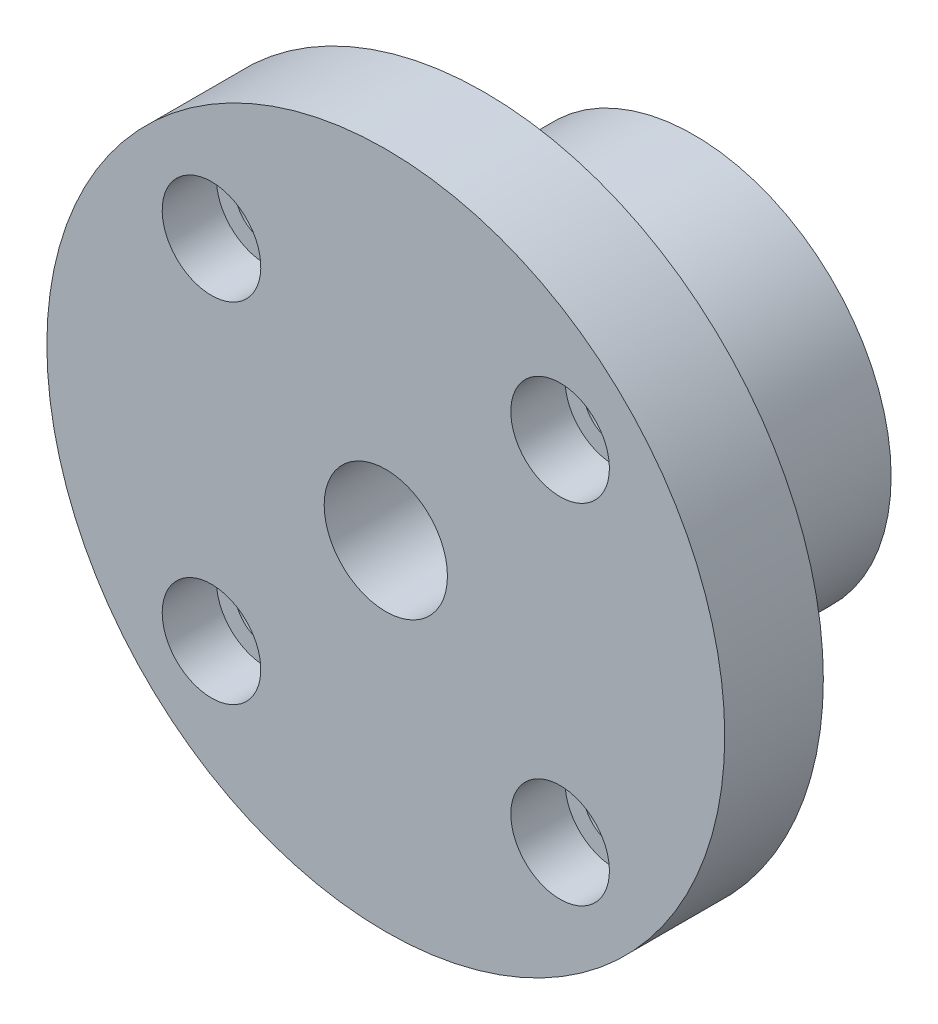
ISO-10303-21;
HEADER;
FILE_DESCRIPTION(('STEP AP214'),'2;1');
FILE_NAME('part.step','',(''),(''),'','','');
FILE_SCHEMA(('AUTOMOTIVE_DESIGN { 1 0 10303 214 1 1 1 1 }'));
ENDSEC;
DATA;
#1=APPLICATION_CONTEXT('core data for automotive mechanical design processes');
#2=APPLICATION_PROTOCOL_DEFINITION('international standard','automotive_design',2000,#1);
#3=PRODUCT_CONTEXT('',#1,'mechanical');
#4=PRODUCT('Part','Part','',(#3));
#5=PRODUCT_RELATED_PRODUCT_CATEGORY('part','',(#4));
#6=PRODUCT_DEFINITION_FORMATION('','',#4);
#7=PRODUCT_DEFINITION_CONTEXT('part definition',#1,'design');
#8=PRODUCT_DEFINITION('design','',#6,#7);
#9=PRODUCT_DEFINITION_SHAPE('','',#8);
#10=(LENGTH_UNIT() NAMED_UNIT(*) SI_UNIT(.MILLI.,.METRE.));
#11=(NAMED_UNIT(*) PLANE_ANGLE_UNIT() SI_UNIT($,.RADIAN.));
#12=(NAMED_UNIT(*) SI_UNIT($,.STERADIAN.) SOLID_ANGLE_UNIT());
#13=UNCERTAINTY_MEASURE_WITH_UNIT(LENGTH_MEASURE(1.E-05),#10,'distance_accuracy_value','');
#14=(GEOMETRIC_REPRESENTATION_CONTEXT(3) GLOBAL_UNCERTAINTY_ASSIGNED_CONTEXT((#13)) GLOBAL_UNIT_ASSIGNED_CONTEXT((#10,
#11,#12)) REPRESENTATION_CONTEXT('',''));
#15=CARTESIAN_POINT('',(0.,0.,0.));
#16=DIRECTION('',(0.,0.,1.));
#17=DIRECTION('',(1.,0.,0.));
#18=AXIS2_PLACEMENT_3D('',#15,#16,#17);
#19=CARTESIAN_POINT('',(0.,0.,0.));
#20=DIRECTION('',(0.,0.,1.));
#21=DIRECTION('',(1.,0.,0.));
#22=AXIS2_PLACEMENT_3D('',#19,#20,#21);
#23=PLANE('',#22);
#24=CARTESIAN_POINT('',(0.,0.,0.));
#25=DIRECTION('',(0.,0.,1.));
#26=DIRECTION('',(1.,0.,0.));
#27=AXIS2_PLACEMENT_3D('',#24,#25,#26);
#28=CIRCLE('',#27,27.5);
#29=CARTESIAN_POINT('',(27.5,0.,0.));
#30=VERTEX_POINT('',#29);
#31=EDGE_CURVE('E25',#30,#30,#28,.T.);
#32=ORIENTED_EDGE('',*,*,#31,.F.);
#33=EDGE_LOOP('',(#32));
#34=FACE_BOUND('',#33,.T.);
#35=CARTESIAN_POINT('',(14.1421356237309,14.142135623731,0.));
#36=DIRECTION('',(0.,0.,1.));
#37=DIRECTION('',(1.,0.,0.));
#38=AXIS2_PLACEMENT_3D('',#35,#36,#37);
#39=CIRCLE('',#38,2.5);
#40=CARTESIAN_POINT('',(16.6421356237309,14.142135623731,0.));
#41=VERTEX_POINT('',#40);
#42=EDGE_CURVE('E67',#41,#41,#39,.T.);
#43=ORIENTED_EDGE('',*,*,#42,.T.);
#44=EDGE_LOOP('',(#43));
#45=FACE_BOUND('',#44,.T.);
#46=CARTESIAN_POINT('',(14.142135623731,-14.1421356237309,0.));
#47=DIRECTION('',(0.,0.,1.));
#48=DIRECTION('',(0.,-1.,0.));
#49=AXIS2_PLACEMENT_3D('',#46,#47,#48);
#50=CIRCLE('',#49,2.5);
#51=CARTESIAN_POINT('',(14.142135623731,-16.6421356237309,0.));
#52=VERTEX_POINT('',#51);
#53=EDGE_CURVE('E57',#52,#52,#50,.T.);
#54=ORIENTED_EDGE('',*,*,#53,.T.);
#55=EDGE_LOOP('',(#54));
#56=FACE_BOUND('',#55,.T.);
#57=CARTESIAN_POINT('',(-14.142135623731,-14.1421356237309,0.));
#58=DIRECTION('',(0.,0.,1.));
#59=DIRECTION('',(-1.,0.,0.));
#60=AXIS2_PLACEMENT_3D('',#57,#58,#59);
#61=CIRCLE('',#60,2.5);
#62=CARTESIAN_POINT('',(-16.642135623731,-14.1421356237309,0.));
#63=VERTEX_POINT('',#62);
#64=EDGE_CURVE('E54',#63,#63,#61,.T.);
#65=ORIENTED_EDGE('',*,*,#64,.T.);
#66=EDGE_LOOP('',(#65));
#67=FACE_BOUND('',#66,.T.);
#68=CARTESIAN_POINT('',(-14.1421356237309,14.142135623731,0.));
#69=DIRECTION('',(0.,0.,1.));
#70=DIRECTION('',(0.,1.,0.));
#71=AXIS2_PLACEMENT_3D('',#68,#69,#70);
#72=CIRCLE('',#71,2.5);
#73=CARTESIAN_POINT('',(-14.1421356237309,16.642135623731,0.));
#74=VERTEX_POINT('',#73);
#75=EDGE_CURVE('E51',#74,#74,#72,.T.);
#76=ORIENTED_EDGE('',*,*,#75,.T.);
#77=EDGE_LOOP('',(#76));
#78=FACE_BOUND('',#77,.T.);
#79=CARTESIAN_POINT('',(0.,0.,0.));
#80=DIRECTION('',(0.,0.,1.));
#81=DIRECTION('',(1.,0.,0.));
#82=AXIS2_PLACEMENT_3D('',#79,#80,#81);
#83=CIRCLE('',#82,16.);
#84=CARTESIAN_POINT('',(16.,0.,0.));
#85=VERTEX_POINT('',#84);
#86=EDGE_CURVE('E8',#85,#85,#83,.F.);
#87=ORIENTED_EDGE('',*,*,#86,.F.);
#88=EDGE_LOOP('',(#87));
#89=FACE_BOUND('',#88,.T.);
#90=ADVANCED_FACE('F12',(#34,#45,#56,#67,#78,#89),#23,.F.);
#91=CARTESIAN_POINT('',(-14.1421356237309,14.142135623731,0.));
#92=DIRECTION('',(0.,0.,1.));
#93=DIRECTION('',(1.,0.,0.));
#94=AXIS2_PLACEMENT_3D('',#91,#92,#93);
#95=CYLINDRICAL_SURFACE('',#94,2.5);
#96=ORIENTED_EDGE('',*,*,#75,.F.);
#97=EDGE_LOOP('',(#96));
#98=FACE_BOUND('',#97,.T.);
#99=CARTESIAN_POINT('',(-14.1421356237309,14.142135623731,3.6));
#100=DIRECTION('',(0.,0.,1.));
#101=DIRECTION('',(1.,0.,0.));
#102=AXIS2_PLACEMENT_3D('',#99,#100,#101);
#103=CIRCLE('',#102,2.5);
#104=CARTESIAN_POINT('',(-11.6421356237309,14.142135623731,3.6));
#105=VERTEX_POINT('',#104);
#106=EDGE_CURVE('E16',#105,#105,#103,.F.);
#107=ORIENTED_EDGE('',*,*,#106,.F.);
#108=EDGE_LOOP('',(#107));
#109=FACE_BOUND('',#108,.T.);
#110=ADVANCED_FACE('F86',(#98,#109),#95,.F.);
#111=CARTESIAN_POINT('',(-14.142135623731,-14.1421356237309,0.));
#112=DIRECTION('',(0.,0.,1.));
#113=DIRECTION('',(1.,0.,0.));
#114=AXIS2_PLACEMENT_3D('',#111,#112,#113);
#115=CYLINDRICAL_SURFACE('',#114,2.5);
#116=ORIENTED_EDGE('',*,*,#64,.F.);
#117=EDGE_LOOP('',(#116));
#118=FACE_BOUND('',#117,.T.);
#119=CARTESIAN_POINT('',(-14.142135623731,-14.1421356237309,3.6));
#120=DIRECTION('',(0.,0.,1.));
#121=DIRECTION('',(1.,0.,0.));
#122=AXIS2_PLACEMENT_3D('',#119,#120,#121);
#123=CIRCLE('',#122,2.5);
#124=CARTESIAN_POINT('',(-11.642135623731,-14.1421356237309,3.6));
#125=VERTEX_POINT('',#124);
#126=EDGE_CURVE('E43',#125,#125,#123,.F.);
#127=ORIENTED_EDGE('',*,*,#126,.F.);
#128=EDGE_LOOP('',(#127));
#129=FACE_BOUND('',#128,.T.);
#130=ADVANCED_FACE('F83',(#118,#129),#115,.F.);
#131=CARTESIAN_POINT('',(14.142135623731,-14.1421356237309,0.));
#132=DIRECTION('',(0.,0.,1.));
#133=DIRECTION('',(1.,0.,0.));
#134=AXIS2_PLACEMENT_3D('',#131,#132,#133);
#135=CYLINDRICAL_SURFACE('',#134,2.5);
#136=ORIENTED_EDGE('',*,*,#53,.F.);
#137=EDGE_LOOP('',(#136));
#138=FACE_BOUND('',#137,.T.);
#139=CARTESIAN_POINT('',(14.142135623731,-14.1421356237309,3.6));
#140=DIRECTION('',(0.,0.,1.));
#141=DIRECTION('',(1.,0.,0.));
#142=AXIS2_PLACEMENT_3D('',#139,#140,#141);
#143=CIRCLE('',#142,2.5);
#144=CARTESIAN_POINT('',(16.642135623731,-14.1421356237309,3.6));
#145=VERTEX_POINT('',#144);
#146=EDGE_CURVE('E50',#145,#145,#143,.F.);
#147=ORIENTED_EDGE('',*,*,#146,.F.);
#148=EDGE_LOOP('',(#147));
#149=FACE_BOUND('',#148,.T.);
#150=ADVANCED_FACE('F85',(#138,#149),#135,.F.);
#151=CARTESIAN_POINT('',(14.1421356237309,14.142135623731,0.));
#152=DIRECTION('',(0.,0.,1.));
#153=DIRECTION('',(1.,0.,0.));
#154=AXIS2_PLACEMENT_3D('',#151,#152,#153);
#155=CYLINDRICAL_SURFACE('',#154,2.5);
#156=ORIENTED_EDGE('',*,*,#42,.F.);
#157=EDGE_LOOP('',(#156));
#158=FACE_BOUND('',#157,.T.);
#159=CARTESIAN_POINT('',(14.1421356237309,14.142135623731,3.6));
#160=DIRECTION('',(0.,0.,1.));
#161=DIRECTION('',(1.,0.,0.));
#162=AXIS2_PLACEMENT_3D('',#159,#160,#161);
#163=CIRCLE('',#162,2.5);
#164=CARTESIAN_POINT('',(16.6421356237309,14.142135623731,3.6));
#165=VERTEX_POINT('',#164);
#166=EDGE_CURVE('E66',#165,#165,#163,.F.);
#167=ORIENTED_EDGE('',*,*,#166,.F.);
#168=EDGE_LOOP('',(#167));
#169=FACE_BOUND('',#168,.T.);
#170=ADVANCED_FACE('F94',(#158,#169),#155,.F.);
#171=CARTESIAN_POINT('',(0.,0.,8.));
#172=DIRECTION('',(0.,0.,1.));
#173=DIRECTION('',(1.,0.,0.));
#174=AXIS2_PLACEMENT_3D('',#171,#172,#173);
#175=PLANE('',#174);
#176=CARTESIAN_POINT('',(-14.142135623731,-14.1421356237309,8.));
#177=DIRECTION('',(0.,0.,1.));
#178=DIRECTION('',(-1.,0.,0.));
#179=AXIS2_PLACEMENT_3D('',#176,#177,#178);
#180=CIRCLE('',#179,4.);
#181=CARTESIAN_POINT('',(-18.142135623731,-14.1421356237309,8.));
#182=VERTEX_POINT('',#181);
#183=EDGE_CURVE('E37',#182,#182,#180,.T.);
#184=ORIENTED_EDGE('',*,*,#183,.F.);
#185=EDGE_LOOP('',(#184));
#186=FACE_BOUND('',#185,.T.);
#187=CARTESIAN_POINT('',(-14.1421356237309,14.142135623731,8.));
#188=DIRECTION('',(0.,0.,1.));
#189=DIRECTION('',(0.,1.,0.));
#190=AXIS2_PLACEMENT_3D('',#187,#188,#189);
#191=CIRCLE('',#190,4.);
#192=CARTESIAN_POINT('',(-14.1421356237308,18.142135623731,8.));
#193=VERTEX_POINT('',#192);
#194=EDGE_CURVE('E31',#193,#193,#191,.T.);
#195=ORIENTED_EDGE('',*,*,#194,.F.);
#196=EDGE_LOOP('',(#195));
#197=FACE_BOUND('',#196,.T.);
#198=CARTESIAN_POINT('',(14.1421356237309,14.142135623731,8.));
#199=DIRECTION('',(0.,0.,1.));
#200=DIRECTION('',(1.,0.,0.));
#201=AXIS2_PLACEMENT_3D('',#198,#199,#200);
#202=CIRCLE('',#201,4.);
#203=CARTESIAN_POINT('',(18.1421356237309,14.142135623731,8.));
#204=VERTEX_POINT('',#203);
#205=EDGE_CURVE('E60',#204,#204,#202,.T.);
#206=ORIENTED_EDGE('',*,*,#205,.F.);
#207=EDGE_LOOP('',(#206));
#208=FACE_BOUND('',#207,.T.);
#209=CARTESIAN_POINT('',(14.142135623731,-14.1421356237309,8.));
#210=DIRECTION('',(0.,0.,1.));
#211=DIRECTION('',(0.,-1.,0.));
#212=AXIS2_PLACEMENT_3D('',#209,#210,#211);
#213=CIRCLE('',#212,4.);
#214=CARTESIAN_POINT('',(14.142135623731,-18.1421356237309,8.));
#215=VERTEX_POINT('',#214);
#216=EDGE_CURVE('E44',#215,#215,#213,.T.);
#217=ORIENTED_EDGE('',*,*,#216,.F.);
#218=EDGE_LOOP('',(#217));
#219=FACE_BOUND('',#218,.T.);
#220=CARTESIAN_POINT('',(0.,0.,8.));
#221=DIRECTION('',(0.,0.,1.));
#222=DIRECTION('',(1.,0.,0.));
#223=AXIS2_PLACEMENT_3D('',#220,#221,#222);
#224=CIRCLE('',#223,5.);
#225=CARTESIAN_POINT('',(5.,0.,8.));
#226=VERTEX_POINT('',#225);
#227=EDGE_CURVE('E70',#226,#226,#224,.T.);
#228=ORIENTED_EDGE('',*,*,#227,.F.);
#229=EDGE_LOOP('',(#228));
#230=FACE_BOUND('',#229,.T.);
#231=CARTESIAN_POINT('',(0.,0.,8.));
#232=DIRECTION('',(0.,0.,1.));
#233=DIRECTION('',(1.,0.,0.));
#234=AXIS2_PLACEMENT_3D('',#231,#232,#233);
#235=CIRCLE('',#234,27.5);
#236=CARTESIAN_POINT('',(27.5,0.,8.));
#237=VERTEX_POINT('',#236);
#238=EDGE_CURVE('E20',#237,#237,#235,.T.);
#239=ORIENTED_EDGE('',*,*,#238,.T.);
#240=EDGE_LOOP('',(#239));
#241=FACE_BOUND('',#240,.T.);
#242=ADVANCED_FACE('F110',(#186,#197,#208,#219,#230,#241),#175,.T.);
#243=CARTESIAN_POINT('',(0.,0.,8.));
#244=DIRECTION('',(0.,0.,-1.));
#245=DIRECTION('',(-1.,0.,0.));
#246=AXIS2_PLACEMENT_3D('',#243,#244,#245);
#247=CYLINDRICAL_SURFACE('',#246,27.5);
#248=ORIENTED_EDGE('',*,*,#238,.F.);
#249=EDGE_LOOP('',(#248));
#250=FACE_BOUND('',#249,.T.);
#251=ORIENTED_EDGE('',*,*,#31,.T.);
#252=EDGE_LOOP('',(#251));
#253=FACE_BOUND('',#252,.T.);
#254=ADVANCED_FACE('F14',(#250,#253),#247,.T.);
#255=CARTESIAN_POINT('',(0.,0.,8.));
#256=DIRECTION('',(0.,0.,-1.));
#257=DIRECTION('',(-1.,0.,0.));
#258=AXIS2_PLACEMENT_3D('',#255,#256,#257);
#259=CYLINDRICAL_SURFACE('',#258,5.);
#260=ORIENTED_EDGE('',*,*,#227,.T.);
#261=EDGE_LOOP('',(#260));
#262=FACE_BOUND('',#261,.T.);
#263=CARTESIAN_POINT('',(0.,0.,-17.));
#264=DIRECTION('',(0.,0.,-1.));
#265=DIRECTION('',(-1.,0.,0.));
#266=AXIS2_PLACEMENT_3D('',#263,#264,#265);
#267=CIRCLE('',#266,5.);
#268=CARTESIAN_POINT('',(-5.,0.,-17.));
#269=VERTEX_POINT('',#268);
#270=EDGE_CURVE('E137',#269,#269,#267,.T.);
#271=ORIENTED_EDGE('',*,*,#270,.T.);
#272=EDGE_LOOP('',(#271));
#273=FACE_BOUND('',#272,.T.);
#274=ADVANCED_FACE('F108',(#262,#273),#259,.F.);
#275=CARTESIAN_POINT('',(14.1421356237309,14.142135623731,3.6));
#276=DIRECTION('',(0.,0.,1.));
#277=DIRECTION('',(1.,0.,0.));
#278=AXIS2_PLACEMENT_3D('',#275,#276,#277);
#279=PLANE('',#278);
#280=CARTESIAN_POINT('',(14.1421356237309,14.142135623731,3.6));
#281=DIRECTION('',(0.,0.,1.));
#282=DIRECTION('',(1.,0.,0.));
#283=AXIS2_PLACEMENT_3D('',#280,#281,#282);
#284=CIRCLE('',#283,4.);
#285=CARTESIAN_POINT('',(18.1421356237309,14.142135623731,3.6));
#286=VERTEX_POINT('',#285);
#287=EDGE_CURVE('E63',#286,#286,#284,.T.);
#288=ORIENTED_EDGE('',*,*,#287,.T.);
#289=EDGE_LOOP('',(#288));
#290=FACE_BOUND('',#289,.T.);
#291=ORIENTED_EDGE('',*,*,#166,.T.);
#292=EDGE_LOOP('',(#291));
#293=FACE_BOUND('',#292,.T.);
#294=ADVANCED_FACE('F134',(#290,#293),#279,.T.);
#295=CARTESIAN_POINT('',(14.1421356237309,14.142135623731,3.6));
#296=DIRECTION('',(0.,0.,1.));
#297=DIRECTION('',(1.,0.,0.));
#298=AXIS2_PLACEMENT_3D('',#295,#296,#297);
#299=CYLINDRICAL_SURFACE('',#298,4.);
#300=ORIENTED_EDGE('',*,*,#205,.T.);
#301=EDGE_LOOP('',(#300));
#302=FACE_BOUND('',#301,.T.);
#303=ORIENTED_EDGE('',*,*,#287,.F.);
#304=EDGE_LOOP('',(#303));
#305=FACE_BOUND('',#304,.T.);
#306=ADVANCED_FACE('F171',(#302,#305),#299,.F.);
#307=CARTESIAN_POINT('',(14.142135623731,-14.1421356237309,3.6));
#308=DIRECTION('',(0.,0.,1.));
#309=DIRECTION('',(1.,0.,0.));
#310=AXIS2_PLACEMENT_3D('',#307,#308,#309);
#311=PLANE('',#310);
#312=CARTESIAN_POINT('',(14.142135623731,-14.1421356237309,3.6));
#313=DIRECTION('',(0.,0.,1.));
#314=DIRECTION('',(0.,-1.,0.));
#315=AXIS2_PLACEMENT_3D('',#312,#313,#314);
#316=CIRCLE('',#315,4.);
#317=CARTESIAN_POINT('',(14.142135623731,-18.1421356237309,3.6));
#318=VERTEX_POINT('',#317);
#319=EDGE_CURVE('E47',#318,#318,#316,.T.);
#320=ORIENTED_EDGE('',*,*,#319,.T.);
#321=EDGE_LOOP('',(#320));
#322=FACE_BOUND('',#321,.T.);
#323=ORIENTED_EDGE('',*,*,#146,.T.);
#324=EDGE_LOOP('',(#323));
#325=FACE_BOUND('',#324,.T.);
#326=ADVANCED_FACE('F168',(#322,#325),#311,.T.);
#327=CARTESIAN_POINT('',(14.142135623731,-14.1421356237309,3.6));
#328=DIRECTION('',(0.,0.,1.));
#329=DIRECTION('',(1.,0.,0.));
#330=AXIS2_PLACEMENT_3D('',#327,#328,#329);
#331=CYLINDRICAL_SURFACE('',#330,4.);
#332=ORIENTED_EDGE('',*,*,#216,.T.);
#333=EDGE_LOOP('',(#332));
#334=FACE_BOUND('',#333,.T.);
#335=ORIENTED_EDGE('',*,*,#319,.F.);
#336=EDGE_LOOP('',(#335));
#337=FACE_BOUND('',#336,.T.);
#338=ADVANCED_FACE('F163',(#334,#337),#331,.F.);
#339=CARTESIAN_POINT('',(-14.142135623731,-14.1421356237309,3.6));
#340=DIRECTION('',(0.,0.,1.));
#341=DIRECTION('',(1.,0.,0.));
#342=AXIS2_PLACEMENT_3D('',#339,#340,#341);
#343=PLANE('',#342);
#344=CARTESIAN_POINT('',(-14.142135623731,-14.1421356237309,3.6));
#345=DIRECTION('',(0.,0.,1.));
#346=DIRECTION('',(-1.,0.,0.));
#347=AXIS2_PLACEMENT_3D('',#344,#345,#346);
#348=CIRCLE('',#347,4.);
#349=CARTESIAN_POINT('',(-18.142135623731,-14.1421356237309,3.6));
#350=VERTEX_POINT('',#349);
#351=EDGE_CURVE('E40',#350,#350,#348,.T.);
#352=ORIENTED_EDGE('',*,*,#351,.T.);
#353=EDGE_LOOP('',(#352));
#354=FACE_BOUND('',#353,.T.);
#355=ORIENTED_EDGE('',*,*,#126,.T.);
#356=EDGE_LOOP('',(#355));
#357=FACE_BOUND('',#356,.T.);
#358=ADVANCED_FACE('F81',(#354,#357),#343,.T.);
#359=CARTESIAN_POINT('',(-14.142135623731,-14.1421356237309,3.6));
#360=DIRECTION('',(0.,0.,1.));
#361=DIRECTION('',(1.,0.,0.));
#362=AXIS2_PLACEMENT_3D('',#359,#360,#361);
#363=CYLINDRICAL_SURFACE('',#362,4.);
#364=ORIENTED_EDGE('',*,*,#183,.T.);
#365=EDGE_LOOP('',(#364));
#366=FACE_BOUND('',#365,.T.);
#367=ORIENTED_EDGE('',*,*,#351,.F.);
#368=EDGE_LOOP('',(#367));
#369=FACE_BOUND('',#368,.T.);
#370=ADVANCED_FACE('F158',(#366,#369),#363,.F.);
#371=CARTESIAN_POINT('',(-14.1421356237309,14.142135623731,3.6));
#372=DIRECTION('',(0.,0.,1.));
#373=DIRECTION('',(1.,0.,0.));
#374=AXIS2_PLACEMENT_3D('',#371,#372,#373);
#375=PLANE('',#374);
#376=CARTESIAN_POINT('',(-14.1421356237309,14.142135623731,3.6));
#377=DIRECTION('',(0.,0.,1.));
#378=DIRECTION('',(0.,1.,0.));
#379=AXIS2_PLACEMENT_3D('',#376,#377,#378);
#380=CIRCLE('',#379,4.);
#381=CARTESIAN_POINT('',(-14.1421356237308,18.142135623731,3.6));
#382=VERTEX_POINT('',#381);
#383=EDGE_CURVE('E34',#382,#382,#380,.T.);
#384=ORIENTED_EDGE('',*,*,#383,.T.);
#385=EDGE_LOOP('',(#384));
#386=FACE_BOUND('',#385,.T.);
#387=ORIENTED_EDGE('',*,*,#106,.T.);
#388=EDGE_LOOP('',(#387));
#389=FACE_BOUND('',#388,.T.);
#390=ADVANCED_FACE('F153',(#386,#389),#375,.T.);
#391=CARTESIAN_POINT('',(-14.1421356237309,14.142135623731,3.6));
#392=DIRECTION('',(0.,0.,1.));
#393=DIRECTION('',(1.,0.,0.));
#394=AXIS2_PLACEMENT_3D('',#391,#392,#393);
#395=CYLINDRICAL_SURFACE('',#394,4.);
#396=ORIENTED_EDGE('',*,*,#194,.T.);
#397=EDGE_LOOP('',(#396));
#398=FACE_BOUND('',#397,.T.);
#399=ORIENTED_EDGE('',*,*,#383,.F.);
#400=EDGE_LOOP('',(#399));
#401=FACE_BOUND('',#400,.T.);
#402=ADVANCED_FACE('F146',(#398,#401),#395,.F.);
#403=CARTESIAN_POINT('',(0.,0.,-17.));
#404=DIRECTION('',(0.,0.,1.));
#405=DIRECTION('',(1.,0.,0.));
#406=AXIS2_PLACEMENT_3D('',#403,#404,#405);
#407=CYLINDRICAL_SURFACE('',#406,16.);
#408=CARTESIAN_POINT('',(0.,0.,-17.));
#409=DIRECTION('',(0.,0.,-1.));
#410=DIRECTION('',(-1.,0.,0.));
#411=AXIS2_PLACEMENT_3D('',#408,#409,#410);
#412=CIRCLE('',#411,16.);
#413=CARTESIAN_POINT('',(-16.,0.,-17.));
#414=VERTEX_POINT('',#413);
#415=EDGE_CURVE('E29',#414,#414,#412,.T.);
#416=ORIENTED_EDGE('',*,*,#415,.F.);
#417=EDGE_LOOP('',(#416));
#418=FACE_BOUND('',#417,.T.);
#419=ORIENTED_EDGE('',*,*,#86,.T.);
#420=EDGE_LOOP('',(#419));
#421=FACE_BOUND('',#420,.T.);
#422=ADVANCED_FACE('F144',(#418,#421),#407,.T.);
#423=CARTESIAN_POINT('',(0.,0.,-17.));
#424=DIRECTION('',(0.,0.,-1.));
#425=DIRECTION('',(-1.,0.,0.));
#426=AXIS2_PLACEMENT_3D('',#423,#424,#425);
#427=PLANE('',#426);
#428=ORIENTED_EDGE('',*,*,#415,.T.);
#429=EDGE_LOOP('',(#428));
#430=FACE_BOUND('',#429,.T.);
#431=ORIENTED_EDGE('',*,*,#270,.F.);
#432=EDGE_LOOP('',(#431));
#433=FACE_BOUND('',#432,.T.);
#434=ADVANCED_FACE('F142',(#430,#433),#427,.T.);
#435=CLOSED_SHELL('',(#90,#110,#130,#150,#170,#242,#254,#274,#294,#306,#326,#338,#358,#370,#390,
#402,#422,#434));
#436=MANIFOLD_SOLID_BREP('B1',#435);
#437=ADVANCED_BREP_SHAPE_REPRESENTATION('',(#18,#436),#14);
#438=SHAPE_DEFINITION_REPRESENTATION(#9,#437);
ENDSEC;
END-ISO-10303-21;
